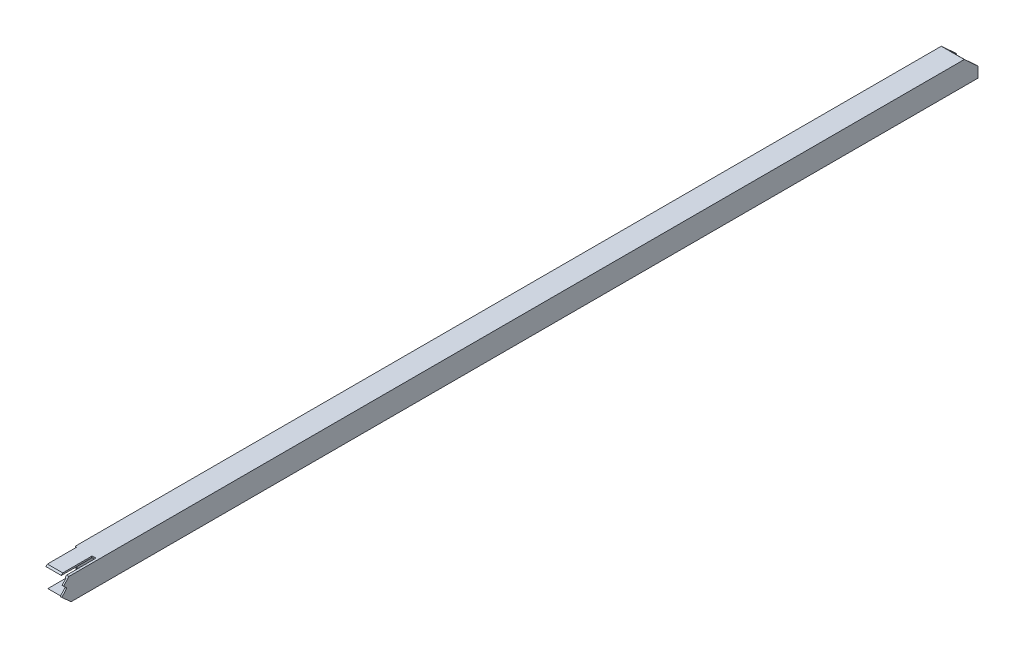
ISO-10303-21;
HEADER;
FILE_DESCRIPTION(('STEP AP214'),'2;1');
FILE_NAME('part.step','',(''),(''),'','','');
FILE_SCHEMA(('AUTOMOTIVE_DESIGN { 1 0 10303 214 1 1 1 1 }'));
ENDSEC;
DATA;
#1=APPLICATION_CONTEXT('core data for automotive mechanical design processes');
#2=APPLICATION_PROTOCOL_DEFINITION('international standard','automotive_design',2000,#1);
#3=PRODUCT_CONTEXT('',#1,'mechanical');
#4=PRODUCT('Part','Part','',(#3));
#5=PRODUCT_RELATED_PRODUCT_CATEGORY('part','',(#4));
#6=PRODUCT_DEFINITION_FORMATION('','',#4);
#7=PRODUCT_DEFINITION_CONTEXT('part definition',#1,'design');
#8=PRODUCT_DEFINITION('design','',#6,#7);
#9=PRODUCT_DEFINITION_SHAPE('','',#8);
#10=(LENGTH_UNIT() NAMED_UNIT(*) SI_UNIT(.MILLI.,.METRE.));
#11=(NAMED_UNIT(*) PLANE_ANGLE_UNIT() SI_UNIT($,.RADIAN.));
#12=(NAMED_UNIT(*) SI_UNIT($,.STERADIAN.) SOLID_ANGLE_UNIT());
#13=UNCERTAINTY_MEASURE_WITH_UNIT(LENGTH_MEASURE(1.E-05),#10,'distance_accuracy_value','');
#14=(GEOMETRIC_REPRESENTATION_CONTEXT(3) GLOBAL_UNCERTAINTY_ASSIGNED_CONTEXT((#13)) GLOBAL_UNIT_ASSIGNED_CONTEXT((#10,
#11,#12)) REPRESENTATION_CONTEXT('',''));
#15=CARTESIAN_POINT('',(0.,0.,0.));
#16=DIRECTION('',(0.,0.,1.));
#17=DIRECTION('',(1.,0.,0.));
#18=AXIS2_PLACEMENT_3D('',#15,#16,#17);
#19=CARTESIAN_POINT('',(24.,3.344636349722,2323.848652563));
#20=DIRECTION('',(-1.,0.,0.));
#21=DIRECTION('',(0.,0.,1.));
#22=AXIS2_PLACEMENT_3D('',#19,#20,#21);
#23=PLANE('',#22);
#24=DIRECTION('',(0.,0.,-1.));
#25=VECTOR('',#24,1.);
#26=CARTESIAN_POINT('',(24.,30.,1161.924326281));
#27=LINE('',#26,#25);
#28=CARTESIAN_POINT('',(24.,30.,2369.268578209));
#29=VERTEX_POINT('',#28);
#30=CARTESIAN_POINT('',(24.,30.,2294.595069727));
#31=VERTEX_POINT('',#30);
#32=EDGE_CURVE('E155',#29,#31,#27,.T.);
#33=ORIENTED_EDGE('',*,*,#32,.T.);
#34=DIRECTION('',(0.,-0.999022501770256,-0.0442045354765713));
#35=VECTOR('',#34,1.);
#36=CARTESIAN_POINT('',(24.,110.65093685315,2298.163695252));
#37=LINE('',#36,#35);
#38=CARTESIAN_POINT('',(24.,26.,2294.418078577));
#39=VERTEX_POINT('',#38);
#40=EDGE_CURVE('E10',#31,#39,#37,.T.);
#41=ORIENTED_EDGE('',*,*,#40,.T.);
#42=DIRECTION('',(0.,0.,-1.));
#43=VECTOR('',#42,1.);
#44=CARTESIAN_POINT('',(24.,26.,1161.924326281));
#45=LINE('',#44,#43);
#46=CARTESIAN_POINT('',(24.,26.,2372.929595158));
#47=VERTEX_POINT('',#46);
#48=EDGE_CURVE('E152',#47,#39,#45,.T.);
#49=ORIENTED_EDGE('',*,*,#48,.F.);
#50=DIRECTION('',(0.,-0.737672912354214,0.675158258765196));
#51=VECTOR('',#50,1.);
#52=CARTESIAN_POINT('',(24.,645.40501344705,1806.016532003));
#53=LINE('',#52,#51);
#54=EDGE_CURVE('E308',#29,#47,#53,.T.);
#55=ORIENTED_EDGE('',*,*,#54,.F.);
#56=EDGE_LOOP('',(#33,#41,#49,#55));
#57=FACE_BOUND('',#56,.T.);
#58=ADVANCED_FACE('F16',(#57),#23,.T.);
#59=CARTESIAN_POINT('',(22.,110.65093685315,2298.163695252));
#60=DIRECTION('',(0.,-0.999022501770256,-0.0442045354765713));
#61=DIRECTION('',(-1.,0.,0.));
#62=AXIS2_PLACEMENT_3D('',#59,#60,#61);
#63=CYLINDRICAL_SURFACE('',#62,2.);
#64=CARTESIAN_POINT('',(22.000000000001,26.,2294.418078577));
#65=DIRECTION('',(0.,-1.,0.));
#66=DIRECTION('',(0.,0.,-1.));
#67=AXIS2_PLACEMENT_3D('',#64,#65,#66);
#68=ELLIPSE('',#67,2.001956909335,2.);
#69=CARTESIAN_POINT('',(22.,26.,2292.416121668));
#70=VERTEX_POINT('',#69);
#71=EDGE_CURVE('E160',#70,#39,#68,.T.);
#72=ORIENTED_EDGE('',*,*,#71,.T.);
#73=ORIENTED_EDGE('',*,*,#40,.F.);
#74=CARTESIAN_POINT('',(22.000000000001,30.,2294.595069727));
#75=DIRECTION('',(0.,-1.,0.));
#76=DIRECTION('',(0.,0.,-1.));
#77=AXIS2_PLACEMENT_3D('',#74,#75,#76);
#78=ELLIPSE('',#77,2.001956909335,2.);
#79=CARTESIAN_POINT('',(22.,30.,2292.593112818));
#80=VERTEX_POINT('',#79);
#81=EDGE_CURVE('E325',#80,#31,#78,.T.);
#82=ORIENTED_EDGE('',*,*,#81,.F.);
#83=DIRECTION('',(0.,-0.999022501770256,-0.0442045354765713));
#84=VECTOR('',#83,1.);
#85=CARTESIAN_POINT('',(22.,110.7393459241,2296.165650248));
#86=LINE('',#85,#84);
#87=EDGE_CURVE('E25',#80,#70,#86,.T.);
#88=ORIENTED_EDGE('',*,*,#87,.T.);
#89=EDGE_LOOP('',(#72,#73,#82,#88));
#90=FACE_BOUND('',#89,.T.);
#91=ADVANCED_FACE('F161',(#90),#63,.F.);
#92=CARTESIAN_POINT('',(22.,110.7393459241,2296.165650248));
#93=DIRECTION('',(0.,-0.0442045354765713,0.999022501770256));
#94=DIRECTION('',(-1.,0.,0.));
#95=AXIS2_PLACEMENT_3D('',#92,#93,#94);
#96=PLANE('',#95);
#97=ORIENTED_EDGE('',*,*,#87,.F.);
#98=DIRECTION('',(-1.,0.,0.));
#99=VECTOR('',#98,1.);
#100=CARTESIAN_POINT('',(26.,30.,2292.593112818));
#101=LINE('',#100,#99);
#102=CARTESIAN_POINT('',(16.,30.,2292.593112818));
#103=VERTEX_POINT('',#102);
#104=EDGE_CURVE('E321',#80,#103,#101,.T.);
#105=ORIENTED_EDGE('',*,*,#104,.T.);
#106=DIRECTION('',(0.,-0.999022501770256,-0.0442045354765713));
#107=VECTOR('',#106,1.);
#108=CARTESIAN_POINT('',(16.,110.7393459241,2296.165650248));
#109=LINE('',#108,#107);
#110=CARTESIAN_POINT('',(16.,26.,2292.416121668));
#111=VERTEX_POINT('',#110);
#112=EDGE_CURVE('E242',#103,#111,#109,.T.);
#113=ORIENTED_EDGE('',*,*,#112,.T.);
#114=DIRECTION('',(-1.,0.,0.));
#115=VECTOR('',#114,1.);
#116=CARTESIAN_POINT('',(24.,26.,2292.416121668));
#117=LINE('',#116,#115);
#118=EDGE_CURVE('E166',#70,#111,#117,.T.);
#119=ORIENTED_EDGE('',*,*,#118,.F.);
#120=EDGE_LOOP('',(#97,#105,#113,#119));
#121=FACE_BOUND('',#120,.T.);
#122=ADVANCED_FACE('F695',(#121),#96,.T.);
#123=CARTESIAN_POINT('',(16.,110.65093685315,2298.163695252));
#124=DIRECTION('',(0.,-0.999022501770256,-0.0442045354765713));
#125=DIRECTION('',(1.,0.,0.));
#126=AXIS2_PLACEMENT_3D('',#123,#124,#125);
#127=CYLINDRICAL_SURFACE('',#126,2.);
#128=ORIENTED_EDGE('',*,*,#112,.F.);
#129=CARTESIAN_POINT('',(16.,30.,2294.595069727));
#130=DIRECTION('',(0.,-1.,0.));
#131=DIRECTION('',(0.,0.,-1.));
#132=AXIS2_PLACEMENT_3D('',#129,#130,#131);
#133=ELLIPSE('',#132,2.001956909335,2.);
#134=CARTESIAN_POINT('',(14.,30.,2294.595069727));
#135=VERTEX_POINT('',#134);
#136=EDGE_CURVE('E317',#135,#103,#133,.T.);
#137=ORIENTED_EDGE('',*,*,#136,.F.);
#138=DIRECTION('',(0.,-0.999022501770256,-0.0442045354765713));
#139=VECTOR('',#138,1.);
#140=CARTESIAN_POINT('',(14.,110.65093685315,2298.163695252));
#141=LINE('',#140,#139);
#142=CARTESIAN_POINT('',(14.,26.,2294.418078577));
#143=VERTEX_POINT('',#142);
#144=EDGE_CURVE('E239',#135,#143,#141,.T.);
#145=ORIENTED_EDGE('',*,*,#144,.T.);
#146=CARTESIAN_POINT('',(16.,26.,2294.418078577));
#147=DIRECTION('',(0.,-1.,0.));
#148=DIRECTION('',(0.,0.,-1.));
#149=AXIS2_PLACEMENT_3D('',#146,#147,#148);
#150=ELLIPSE('',#149,2.001956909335,2.);
#151=EDGE_CURVE('E228',#143,#111,#150,.T.);
#152=ORIENTED_EDGE('',*,*,#151,.T.);
#153=EDGE_LOOP('',(#128,#137,#145,#152));
#154=FACE_BOUND('',#153,.T.);
#155=ADVANCED_FACE('F694',(#154),#127,.F.);
#156=CARTESIAN_POINT('',(14.,3.344636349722,2323.848652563));
#157=DIRECTION('',(-1.,0.,0.));
#158=DIRECTION('',(0.,0.,1.));
#159=AXIS2_PLACEMENT_3D('',#156,#157,#158);
#160=PLANE('',#159);
#161=DIRECTION('',(0.,-0.737672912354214,0.675158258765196));
#162=VECTOR('',#161,1.);
#163=CARTESIAN_POINT('',(14.,645.40501344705,1806.016532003));
#164=LINE('',#163,#162);
#165=CARTESIAN_POINT('',(14.,30.,2369.268578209));
#166=VERTEX_POINT('',#165);
#167=CARTESIAN_POINT('',(14.,26.,2372.929595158));
#168=VERTEX_POINT('',#167);
#169=EDGE_CURVE('E37',#166,#168,#164,.T.);
#170=ORIENTED_EDGE('',*,*,#169,.T.);
#171=DIRECTION('',(0.,0.,-1.));
#172=VECTOR('',#171,1.);
#173=CARTESIAN_POINT('',(14.,26.,1161.924326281));
#174=LINE('',#173,#172);
#175=EDGE_CURVE('E224',#168,#143,#174,.T.);
#176=ORIENTED_EDGE('',*,*,#175,.T.);
#177=ORIENTED_EDGE('',*,*,#144,.F.);
#178=DIRECTION('',(0.,0.,-1.));
#179=VECTOR('',#178,1.);
#180=CARTESIAN_POINT('',(14.,30.,1161.924326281));
#181=LINE('',#180,#179);
#182=EDGE_CURVE('E313',#166,#135,#181,.T.);
#183=ORIENTED_EDGE('',*,*,#182,.F.);
#184=EDGE_LOOP('',(#170,#176,#177,#183));
#185=FACE_BOUND('',#184,.T.);
#186=ADVANCED_FACE('F692',(#185),#160,.F.);
#187=CARTESIAN_POINT('',(-37.5,1252.693634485,1250.193048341));
#188=DIRECTION('',(0.,0.675158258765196,0.737672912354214));
#189=DIRECTION('',(1.,0.,0.));
#190=AXIS2_PLACEMENT_3D('',#187,#188,#189);
#191=PLANE('',#190);
#192=DIRECTION('',(-1.,0.,0.));
#193=VECTOR('',#192,1.);
#194=CARTESIAN_POINT('',(-5.75,26.,2372.929595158));
#195=LINE('',#194,#193);
#196=CARTESIAN_POINT('',(-26.,26.,2372.929595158));
#197=VERTEX_POINT('',#196);
#198=EDGE_CURVE('E227',#168,#197,#195,.T.);
#199=ORIENTED_EDGE('',*,*,#198,.F.);
#200=ORIENTED_EDGE('',*,*,#169,.F.);
#201=DIRECTION('',(-1.,0.,0.));
#202=VECTOR('',#201,1.);
#203=CARTESIAN_POINT('',(-3.75,30.,2369.268578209));
#204=LINE('',#203,#202);
#205=CARTESIAN_POINT('',(-26.,30.,2369.268578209));
#206=VERTEX_POINT('',#205);
#207=EDGE_CURVE('E309',#166,#206,#204,.T.);
#208=ORIENTED_EDGE('',*,*,#207,.T.);
#209=DIRECTION('',(0.,-0.737672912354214,0.675158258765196));
#210=VECTOR('',#209,1.);
#211=CARTESIAN_POINT('',(-26.,645.40501344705,1806.016532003));
#212=LINE('',#211,#210);
#213=EDGE_CURVE('E174',#206,#197,#212,.T.);
#214=ORIENTED_EDGE('',*,*,#213,.T.);
#215=EDGE_LOOP('',(#199,#200,#208,#214));
#216=FACE_BOUND('',#215,.T.);
#217=ADVANCED_FACE('F689',(#216),#191,.T.);
#218=CARTESIAN_POINT('',(26.,26.,0.));
#219=DIRECTION('',(0.,-1.,0.));
#220=DIRECTION('',(0.,0.,-1.));
#221=AXIS2_PLACEMENT_3D('',#218,#219,#220);
#222=PLANE('',#221);
#223=DIRECTION('',(-1.,0.,0.));
#224=VECTOR('',#223,1.);
#225=CARTESIAN_POINT('',(-8.00000005,26.,31.36967599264));
#226=LINE('',#225,#224);
#227=CARTESIAN_POINT('',(26.,26.,31.36967599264));
#228=VERTEX_POINT('',#227);
#229=CARTESIAN_POINT('',(-26.,26.,31.36967599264));
#230=VERTEX_POINT('',#229);
#231=EDGE_CURVE('E247',#228,#230,#226,.T.);
#232=ORIENTED_EDGE('',*,*,#231,.F.);
#233=DIRECTION('',(0.,0.,1.));
#234=VECTOR('',#233,1.);
#235=CARTESIAN_POINT('',(26.,26.,0.));
#236=LINE('',#235,#234);
#237=CARTESIAN_POINT('',(26.,26.,2372.929595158));
#238=VERTEX_POINT('',#237);
#239=EDGE_CURVE('E301',#228,#238,#236,.T.);
#240=ORIENTED_EDGE('',*,*,#239,.T.);
#241=DIRECTION('',(-1.,0.,0.));
#242=VECTOR('',#241,1.);
#243=CARTESIAN_POINT('',(-5.75,26.,2372.929595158));
#244=LINE('',#243,#242);
#245=EDGE_CURVE('E171',#238,#47,#244,.T.);
#246=ORIENTED_EDGE('',*,*,#245,.T.);
#247=ORIENTED_EDGE('',*,*,#48,.T.);
#248=ORIENTED_EDGE('',*,*,#71,.F.);
#249=ORIENTED_EDGE('',*,*,#118,.T.);
#250=ORIENTED_EDGE('',*,*,#151,.F.);
#251=ORIENTED_EDGE('',*,*,#175,.F.);
#252=ORIENTED_EDGE('',*,*,#198,.T.);
#253=DIRECTION('',(0.,0.,1.));
#254=VECTOR('',#253,1.);
#255=CARTESIAN_POINT('',(-26.,26.,0.));
#256=LINE('',#255,#254);
#257=CARTESIAN_POINT('',(-26.,26.,2294.418078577));
#258=VERTEX_POINT('',#257);
#259=EDGE_CURVE('E181',#258,#197,#256,.T.);
#260=ORIENTED_EDGE('',*,*,#259,.F.);
#261=DIRECTION('',(0.,0.,1.));
#262=VECTOR('',#261,1.);
#263=CARTESIAN_POINT('',(-26.,26.,0.));
#264=LINE('',#263,#262);
#265=EDGE_CURVE('E274',#230,#258,#264,.T.);
#266=ORIENTED_EDGE('',*,*,#265,.F.);
#267=EDGE_LOOP('',(#232,#240,#246,#247,#248,#249,#250,#251,#252,#260,#266));
#268=FACE_BOUND('',#267,.T.);
#269=ADVANCED_FACE('F169',(#268),#222,.T.);
#270=CARTESIAN_POINT('',(-26.,3.344636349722,2323.848652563));
#271=DIRECTION('',(-1.,0.,0.));
#272=DIRECTION('',(0.,0.,1.));
#273=AXIS2_PLACEMENT_3D('',#270,#271,#272);
#274=PLANE('',#273);
#275=DIRECTION('',(0.,0.,-1.));
#276=VECTOR('',#275,1.);
#277=CARTESIAN_POINT('',(-26.,30.,1161.924326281));
#278=LINE('',#277,#276);
#279=CARTESIAN_POINT('',(-26.,30.,2294.595069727));
#280=VERTEX_POINT('',#279);
#281=EDGE_CURVE('E304',#206,#280,#278,.T.);
#282=ORIENTED_EDGE('',*,*,#281,.T.);
#283=DIRECTION('',(0.,-0.999022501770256,-0.0442045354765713));
#284=VECTOR('',#283,1.);
#285=CARTESIAN_POINT('',(-26.,110.65093685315,2298.163695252));
#286=LINE('',#285,#284);
#287=EDGE_CURVE('E191',#280,#258,#286,.T.);
#288=ORIENTED_EDGE('',*,*,#287,.T.);
#289=ORIENTED_EDGE('',*,*,#259,.T.);
#290=ORIENTED_EDGE('',*,*,#213,.F.);
#291=EDGE_LOOP('',(#282,#288,#289,#290));
#292=FACE_BOUND('',#291,.T.);
#293=ADVANCED_FACE('F657',(#292),#274,.T.);
#294=CARTESIAN_POINT('',(0.,-38.95913211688,2416.116343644));
#295=DIRECTION('',(0.,0.675158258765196,0.737672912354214));
#296=DIRECTION('',(1.,0.,0.));
#297=AXIS2_PLACEMENT_3D('',#294,#295,#296);
#298=PLANE('',#297);
#299=DIRECTION('',(-1.,0.,0.));
#300=VECTOR('',#299,1.);
#301=CARTESIAN_POINT('',(60.,5.301242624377,2375.606848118));
#302=LINE('',#301,#300);
#303=CARTESIAN_POINT('',(30.,5.301242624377,2375.606848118));
#304=VERTEX_POINT('',#303);
#305=CARTESIAN_POINT('',(26.,5.301242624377,2375.606848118));
#306=VERTEX_POINT('',#305);
#307=EDGE_CURVE('E337',#304,#306,#302,.T.);
#308=ORIENTED_EDGE('',*,*,#307,.T.);
#309=DIRECTION('',(0.,0.737672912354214,-0.675158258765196));
#310=VECTOR('',#309,1.);
#311=CARTESIAN_POINT('',(26.,566.23528790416,1862.209586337));
#312=LINE('',#311,#310);
#313=CARTESIAN_POINT('',(26.,-7.976869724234,2387.759696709));
#314=VERTEX_POINT('',#313);
#315=EDGE_CURVE('E285',#314,#306,#312,.T.);
#316=ORIENTED_EDGE('',*,*,#315,.F.);
#317=DIRECTION('',(-1.,0.,0.));
#318=VECTOR('',#317,1.);
#319=CARTESIAN_POINT('',(-21.00000005,-7.976869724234,2387.759696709));
#320=LINE('',#319,#318);
#321=CARTESIAN_POINT('',(30.,-7.976869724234,2387.759696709));
#322=VERTEX_POINT('',#321);
#323=EDGE_CURVE('E477',#322,#314,#320,.T.);
#324=ORIENTED_EDGE('',*,*,#323,.F.);
#325=DIRECTION('',(0.,0.737672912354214,-0.675158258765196));
#326=VECTOR('',#325,1.);
#327=CARTESIAN_POINT('',(30.,565.14696525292,1863.205678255));
#328=LINE('',#327,#326);
#329=EDGE_CURVE('E466',#322,#304,#328,.T.);
#330=ORIENTED_EDGE('',*,*,#329,.T.);
#331=EDGE_LOOP('',(#308,#316,#324,#330));
#332=FACE_BOUND('',#331,.T.);
#333=ADVANCED_FACE('F712',(#332),#298,.T.);
#334=CARTESIAN_POINT('',(60.,6.651559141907,2377.082193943));
#335=DIRECTION('',(-1.,0.,0.));
#336=DIRECTION('',(0.,0.675158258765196,0.737672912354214));
#337=AXIS2_PLACEMENT_3D('',#334,#335,#336);
#338=CYLINDRICAL_SURFACE('',#337,2.);
#339=CARTESIAN_POINT('',(26.,6.651559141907,2377.082193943));
#340=DIRECTION('',(-1.,0.,0.));
#341=DIRECTION('',(0.,0.675158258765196,0.737672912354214));
#342=AXIS2_PLACEMENT_3D('',#339,#340,#341);
#343=CIRCLE('',#342,2.);
#344=CARTESIAN_POINT('',(26.,8.126904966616,2375.731877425));
#345=VERTEX_POINT('',#344);
#346=EDGE_CURVE('E289',#345,#306,#343,.T.);
#347=ORIENTED_EDGE('',*,*,#346,.T.);
#348=ORIENTED_EDGE('',*,*,#307,.F.);
#349=CARTESIAN_POINT('',(30.,6.651559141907,2377.082193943));
#350=DIRECTION('',(-1.,0.,0.));
#351=DIRECTION('',(0.,0.675158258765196,0.737672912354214));
#352=AXIS2_PLACEMENT_3D('',#349,#350,#351);
#353=CIRCLE('',#352,2.);
#354=CARTESIAN_POINT('',(30.,8.126904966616,2375.731877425));
#355=VERTEX_POINT('',#354);
#356=EDGE_CURVE('E412',#355,#304,#353,.T.);
#357=ORIENTED_EDGE('',*,*,#356,.F.);
#358=DIRECTION('',(-1.,0.,0.));
#359=VECTOR('',#358,1.);
#360=CARTESIAN_POINT('',(60.,8.126904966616,2375.731877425));
#361=LINE('',#360,#359);
#362=EDGE_CURVE('E307',#355,#345,#361,.T.);
#363=ORIENTED_EDGE('',*,*,#362,.T.);
#364=EDGE_LOOP('',(#347,#348,#357,#363));
#365=FACE_BOUND('',#364,.T.);
#366=ADVANCED_FACE('F710',(#365),#338,.F.);
#367=CARTESIAN_POINT('',(60.,8.126904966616,2375.731877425));
#368=DIRECTION('',(0.,-0.737672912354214,0.675158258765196));
#369=DIRECTION('',(-1.,0.,0.));
#370=AXIS2_PLACEMENT_3D('',#367,#368,#369);
#371=PLANE('',#370);
#372=ORIENTED_EDGE('',*,*,#362,.F.);
#373=DIRECTION('',(0.,0.675158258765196,0.737672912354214));
#374=VECTOR('',#373,1.);
#375=CARTESIAN_POINT('',(30.,-592.1747846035,1719.84669808));
#376=LINE('',#375,#374);
#377=CARTESIAN_POINT('',(30.,14.878487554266,2383.108606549));
#378=VERTEX_POINT('',#377);
#379=EDGE_CURVE('E408',#355,#378,#376,.T.);
#380=ORIENTED_EDGE('',*,*,#379,.T.);
#381=DIRECTION('',(1.,0.,0.));
#382=VECTOR('',#381,1.);
#383=CARTESIAN_POINT('',(11.25,14.878487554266,2383.108606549));
#384=LINE('',#383,#382);
#385=CARTESIAN_POINT('',(26.,14.878487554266,2383.108606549));
#386=VERTEX_POINT('',#385);
#387=EDGE_CURVE('E331',#386,#378,#384,.T.);
#388=ORIENTED_EDGE('',*,*,#387,.F.);
#389=DIRECTION('',(0.,0.675158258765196,0.737672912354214));
#390=VECTOR('',#389,1.);
#391=CARTESIAN_POINT('',(26.,-591.2631072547,1720.842789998));
#392=LINE('',#391,#390);
#393=EDGE_CURVE('E293',#345,#386,#392,.T.);
#394=ORIENTED_EDGE('',*,*,#393,.F.);
#395=EDGE_LOOP('',(#372,#380,#388,#394));
#396=FACE_BOUND('',#395,.T.);
#397=ADVANCED_FACE('F707',(#396),#371,.T.);
#398=CARTESIAN_POINT('',(-37.5,1252.693634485,1250.193048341));
#399=DIRECTION('',(0.,0.675158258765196,0.737672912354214));
#400=DIRECTION('',(1.,0.,0.));
#401=AXIS2_PLACEMENT_3D('',#398,#399,#400);
#402=PLANE('',#401);
#403=DIRECTION('',(0.,0.737672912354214,-0.675158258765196));
#404=VECTOR('',#403,1.);
#405=CARTESIAN_POINT('',(26.,1216.112620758,1283.673976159));
#406=LINE('',#405,#404);
#407=EDGE_CURVE('E297',#386,#238,#406,.T.);
#408=ORIENTED_EDGE('',*,*,#407,.F.);
#409=ORIENTED_EDGE('',*,*,#387,.T.);
#410=DIRECTION('',(0.,0.737672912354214,-0.675158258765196));
#411=VECTOR('',#410,1.);
#412=CARTESIAN_POINT('',(30.,1215.024298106,1284.670068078));
#413=LINE('',#412,#411);
#414=CARTESIAN_POINT('',(30.,30.,2369.268578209));
#415=VERTEX_POINT('',#414);
#416=EDGE_CURVE('E413',#378,#415,#413,.T.);
#417=ORIENTED_EDGE('',*,*,#416,.T.);
#418=DIRECTION('',(-1.,0.,0.));
#419=VECTOR('',#418,1.);
#420=CARTESIAN_POINT('',(-3.75,30.,2369.268578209));
#421=LINE('',#420,#419);
#422=EDGE_CURVE('E330',#415,#29,#421,.T.);
#423=ORIENTED_EDGE('',*,*,#422,.T.);
#424=ORIENTED_EDGE('',*,*,#54,.T.);
#425=ORIENTED_EDGE('',*,*,#245,.F.);
#426=EDGE_LOOP('',(#408,#409,#417,#423,#424,#425));
#427=FACE_BOUND('',#426,.T.);
#428=ADVANCED_FACE('F700',(#427),#402,.T.);
#429=CARTESIAN_POINT('',(30.,30.,0.));
#430=DIRECTION('',(0.,-1.,0.));
#431=DIRECTION('',(0.,0.,-1.));
#432=AXIS2_PLACEMENT_3D('',#429,#430,#431);
#433=PLANE('',#432);
#434=DIRECTION('',(0.,0.,1.));
#435=VECTOR('',#434,1.);
#436=CARTESIAN_POINT('',(-30.,30.,0.));
#437=LINE('',#436,#435);
#438=CARTESIAN_POINT('',(-30.,30.,35.74004636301));
#439=VERTEX_POINT('',#438);
#440=CARTESIAN_POINT('',(-30.,30.,2292.593112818));
#441=VERTEX_POINT('',#440);
#442=EDGE_CURVE('E258',#439,#441,#437,.T.);
#443=ORIENTED_EDGE('',*,*,#442,.T.);
#444=DIRECTION('',(-1.,0.,0.));
#445=VECTOR('',#444,1.);
#446=CARTESIAN_POINT('',(1.,30.,2292.593112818));
#447=LINE('',#446,#445);
#448=CARTESIAN_POINT('',(-28.,30.,2292.593112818));
#449=VERTEX_POINT('',#448);
#450=EDGE_CURVE('E253',#449,#441,#447,.T.);
#451=ORIENTED_EDGE('',*,*,#450,.F.);
#452=CARTESIAN_POINT('',(-27.99999999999,30.,2294.595069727));
#453=DIRECTION('',(0.,-1.,0.));
#454=DIRECTION('',(0.,0.,-1.));
#455=AXIS2_PLACEMENT_3D('',#452,#453,#454);
#456=ELLIPSE('',#455,2.001956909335,2.);
#457=EDGE_CURVE('E195',#449,#280,#456,.T.);
#458=ORIENTED_EDGE('',*,*,#457,.T.);
#459=ORIENTED_EDGE('',*,*,#281,.F.);
#460=ORIENTED_EDGE('',*,*,#207,.F.);
#461=ORIENTED_EDGE('',*,*,#182,.T.);
#462=ORIENTED_EDGE('',*,*,#136,.T.);
#463=ORIENTED_EDGE('',*,*,#104,.F.);
#464=ORIENTED_EDGE('',*,*,#81,.T.);
#465=ORIENTED_EDGE('',*,*,#32,.F.);
#466=ORIENTED_EDGE('',*,*,#422,.F.);
#467=DIRECTION('',(0.,0.,1.));
#468=VECTOR('',#467,1.);
#469=CARTESIAN_POINT('',(30.,30.,0.));
#470=LINE('',#469,#468);
#471=CARTESIAN_POINT('',(30.,30.,35.74004636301));
#472=VERTEX_POINT('',#471);
#473=EDGE_CURVE('E455',#472,#415,#470,.T.);
#474=ORIENTED_EDGE('',*,*,#473,.F.);
#475=DIRECTION('',(-1.,0.,0.));
#476=VECTOR('',#475,1.);
#477=CARTESIAN_POINT('',(-6.00000005,30.,35.74004636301));
#478=LINE('',#477,#476);
#479=EDGE_CURVE('E271',#472,#439,#478,.T.);
#480=ORIENTED_EDGE('',*,*,#479,.T.);
#481=EDGE_LOOP('',(#443,#451,#458,#459,#460,#461,#462,#463,#464,#465,#466,#474,#480));
#482=FACE_BOUND('',#481,.T.);
#483=ADVANCED_FACE('F663',(#482),#433,.F.);
#484=CARTESIAN_POINT('',(26.,-26.,0.));
#485=DIRECTION('',(-1.,0.,0.));
#486=DIRECTION('',(0.,0.,1.));
#487=AXIS2_PLACEMENT_3D('',#484,#485,#486);
#488=PLANE('',#487);
#489=DIRECTION('',(0.,1.,0.));
#490=VECTOR('',#489,1.);
#491=CARTESIAN_POINT('',(26.,-26.,0.));
#492=LINE('',#491,#490);
#493=CARTESIAN_POINT('',(26.,-26.,0.));
#494=VERTEX_POINT('',#493);
#495=CARTESIAN_POINT('',(26.,-2.71122887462,0.));
#496=VERTEX_POINT('',#495);
#497=EDGE_CURVE('E430',#494,#496,#492,.T.);
#498=ORIENTED_EDGE('',*,*,#497,.F.);
#499=DIRECTION('',(0.,0.,1.));
#500=VECTOR('',#499,1.);
#501=CARTESIAN_POINT('',(26.,-26.,0.));
#502=LINE('',#501,#500);
#503=CARTESIAN_POINT('',(26.,-26.,2368.067758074));
#504=VERTEX_POINT('',#503);
#505=EDGE_CURVE('E281',#494,#504,#502,.T.);
#506=ORIENTED_EDGE('',*,*,#505,.T.);
#507=DIRECTION('',(0.,0.675158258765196,0.737672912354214));
#508=VECTOR('',#507,1.);
#509=CARTESIAN_POINT('',(26.,-1244.041119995,1037.245052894));
#510=LINE('',#509,#508);
#511=EDGE_CURVE('E490',#504,#314,#510,.T.);
#512=ORIENTED_EDGE('',*,*,#511,.T.);
#513=ORIENTED_EDGE('',*,*,#315,.T.);
#514=ORIENTED_EDGE('',*,*,#346,.F.);
#515=ORIENTED_EDGE('',*,*,#393,.T.);
#516=ORIENTED_EDGE('',*,*,#407,.T.);
#517=ORIENTED_EDGE('',*,*,#239,.F.);
#518=DIRECTION('',(0.,0.675158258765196,0.737672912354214));
#519=VECTOR('',#518,1.);
#520=CARTESIAN_POINT('',(26.,-51.96169377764,-53.81069313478));
#521=LINE('',#520,#519);
#522=EDGE_CURVE('E243',#496,#228,#521,.T.);
#523=ORIENTED_EDGE('',*,*,#522,.F.);
#524=EDGE_LOOP('',(#498,#506,#512,#513,#514,#515,#516,#517,#523));
#525=FACE_BOUND('',#524,.T.);
#526=ADVANCED_FACE('F703',(#525),#488,.T.);
#527=CARTESIAN_POINT('',(-26.,-26.,0.));
#528=DIRECTION('',(0.,1.,0.));
#529=DIRECTION('',(1.,0.,0.));
#530=AXIS2_PLACEMENT_3D('',#527,#528,#529);
#531=PLANE('',#530);
#532=DIRECTION('',(1.,0.,0.));
#533=VECTOR('',#532,1.);
#534=CARTESIAN_POINT('',(-26.,-26.,0.));
#535=LINE('',#534,#533);
#536=CARTESIAN_POINT('',(-26.,-26.,0.));
#537=VERTEX_POINT('',#536);
#538=EDGE_CURVE('E426',#537,#494,#535,.T.);
#539=ORIENTED_EDGE('',*,*,#538,.F.);
#540=DIRECTION('',(0.,0.,1.));
#541=VECTOR('',#540,1.);
#542=CARTESIAN_POINT('',(-26.,-26.,0.));
#543=LINE('',#542,#541);
#544=CARTESIAN_POINT('',(-26.,-26.,2292.117193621));
#545=VERTEX_POINT('',#544);
#546=EDGE_CURVE('E278',#537,#545,#543,.T.);
#547=ORIENTED_EDGE('',*,*,#546,.T.);
#548=DIRECTION('',(0.,0.,1.));
#549=VECTOR('',#548,1.);
#550=CARTESIAN_POINT('',(-26.,-26.,0.));
#551=LINE('',#550,#549);
#552=CARTESIAN_POINT('',(-26.,-26.,2368.067758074));
#553=VERTEX_POINT('',#552);
#554=EDGE_CURVE('E236',#545,#553,#551,.T.);
#555=ORIENTED_EDGE('',*,*,#554,.T.);
#556=DIRECTION('',(1.,0.,0.));
#557=VECTOR('',#556,1.);
#558=CARTESIAN_POINT('',(-34.00000005,-26.,2368.067758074));
#559=LINE('',#558,#557);
#560=CARTESIAN_POINT('',(14.,-26.,2368.067758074));
#561=VERTEX_POINT('',#560);
#562=EDGE_CURVE('E220',#553,#561,#559,.T.);
#563=ORIENTED_EDGE('',*,*,#562,.T.);
#564=DIRECTION('',(0.,0.,1.));
#565=VECTOR('',#564,1.);
#566=CARTESIAN_POINT('',(14.,-26.,1161.924326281));
#567=LINE('',#566,#565);
#568=CARTESIAN_POINT('',(14.,-26.,2292.117193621));
#569=VERTEX_POINT('',#568);
#570=EDGE_CURVE('E212',#569,#561,#567,.T.);
#571=ORIENTED_EDGE('',*,*,#570,.F.);
#572=CARTESIAN_POINT('',(16.,-26.,2292.117193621));
#573=DIRECTION('',(0.,1.,0.));
#574=DIRECTION('',(0.,0.,-1.));
#575=AXIS2_PLACEMENT_3D('',#572,#573,#574);
#576=ELLIPSE('',#575,2.001956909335,2.);
#577=CARTESIAN_POINT('',(16.,-26.,2290.115236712));
#578=VERTEX_POINT('',#577);
#579=EDGE_CURVE('E204',#578,#569,#576,.T.);
#580=ORIENTED_EDGE('',*,*,#579,.F.);
#581=DIRECTION('',(1.,0.,0.));
#582=VECTOR('',#581,1.);
#583=CARTESIAN_POINT('',(-2.,-26.,2290.115236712));
#584=LINE('',#583,#582);
#585=CARTESIAN_POINT('',(22.,-26.,2290.115236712));
#586=VERTEX_POINT('',#585);
#587=EDGE_CURVE('E197',#578,#586,#584,.T.);
#588=ORIENTED_EDGE('',*,*,#587,.T.);
#589=CARTESIAN_POINT('',(22.000000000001,-26.,2292.117193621));
#590=DIRECTION('',(0.,1.,0.));
#591=DIRECTION('',(0.,0.,-1.));
#592=AXIS2_PLACEMENT_3D('',#589,#590,#591);
#593=ELLIPSE('',#592,2.001956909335,2.);
#594=CARTESIAN_POINT('',(24.,-26.,2292.117193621));
#595=VERTEX_POINT('',#594);
#596=EDGE_CURVE('E187',#595,#586,#593,.T.);
#597=ORIENTED_EDGE('',*,*,#596,.F.);
#598=DIRECTION('',(0.,0.,1.));
#599=VECTOR('',#598,1.);
#600=CARTESIAN_POINT('',(24.,-26.,1161.924326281));
#601=LINE('',#600,#599);
#602=CARTESIAN_POINT('',(24.,-26.,2368.067758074));
#603=VERTEX_POINT('',#602);
#604=EDGE_CURVE('E185',#595,#603,#601,.T.);
#605=ORIENTED_EDGE('',*,*,#604,.T.);
#606=DIRECTION('',(1.,0.,0.));
#607=VECTOR('',#606,1.);
#608=CARTESIAN_POINT('',(-34.00000005,-26.,2368.067758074));
#609=LINE('',#608,#607);
#610=EDGE_CURVE('E465',#603,#504,#609,.T.);
#611=ORIENTED_EDGE('',*,*,#610,.T.);
#612=ORIENTED_EDGE('',*,*,#505,.F.);
#613=EDGE_LOOP('',(#539,#547,#555,#563,#571,#580,#588,#597,#605,#611,#612));
#614=FACE_BOUND('',#613,.T.);
#615=ADVANCED_FACE('F514',(#614),#531,.T.);
#616=CARTESIAN_POINT('',(-26.,26.,0.));
#617=DIRECTION('',(1.,0.,0.));
#618=DIRECTION('',(0.,1.,0.));
#619=AXIS2_PLACEMENT_3D('',#616,#617,#618);
#620=PLANE('',#619);
#621=DIRECTION('',(0.,-0.675158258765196,-0.737672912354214));
#622=VECTOR('',#621,1.);
#623=CARTESIAN_POINT('',(-26.,-40.1098882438,-40.86149819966));
#624=LINE('',#623,#622);
#625=CARTESIAN_POINT('',(-26.,-2.71122887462,0.));
#626=VERTEX_POINT('',#625);
#627=EDGE_CURVE('E270',#230,#626,#624,.T.);
#628=ORIENTED_EDGE('',*,*,#627,.F.);
#629=ORIENTED_EDGE('',*,*,#265,.T.);
#630=DIRECTION('',(0.,-0.999022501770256,-0.0442045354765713));
#631=VECTOR('',#630,1.);
#632=CARTESIAN_POINT('',(-26.,110.65093685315,2298.163695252));
#633=LINE('',#632,#631);
#634=EDGE_CURVE('E196',#258,#545,#633,.T.);
#635=ORIENTED_EDGE('',*,*,#634,.T.);
#636=ORIENTED_EDGE('',*,*,#546,.F.);
#637=DIRECTION('',(0.,-1.,0.));
#638=VECTOR('',#637,1.);
#639=CARTESIAN_POINT('',(-26.,26.,0.));
#640=LINE('',#639,#638);
#641=EDGE_CURVE('E431',#626,#537,#640,.T.);
#642=ORIENTED_EDGE('',*,*,#641,.F.);
#643=EDGE_LOOP('',(#628,#629,#635,#636,#642));
#644=FACE_BOUND('',#643,.T.);
#645=ADVANCED_FACE('F670',(#644),#620,.T.);
#646=CARTESIAN_POINT('',(-42.0000001,-90.59623612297,-96.02250791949));
#647=DIRECTION('',(0.,-0.737672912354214,0.675158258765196));
#648=DIRECTION('',(-1.,0.,0.));
#649=AXIS2_PLACEMENT_3D('',#646,#647,#648);
#650=PLANE('',#649);
#651=ORIENTED_EDGE('',*,*,#522,.T.);
#652=ORIENTED_EDGE('',*,*,#231,.T.);
#653=ORIENTED_EDGE('',*,*,#627,.T.);
#654=DIRECTION('',(1.,0.,0.));
#655=VECTOR('',#654,1.);
#656=CARTESIAN_POINT('',(-21.00000005,-2.71122887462,0.));
#657=LINE('',#656,#655);
#658=CARTESIAN_POINT('',(-30.,-2.71122887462,0.));
#659=VERTEX_POINT('',#658);
#660=EDGE_CURVE('E422',#659,#626,#657,.T.);
#661=ORIENTED_EDGE('',*,*,#660,.F.);
#662=DIRECTION('',(0.,-0.675158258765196,-0.737672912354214));
#663=VECTOR('',#662,1.);
#664=CARTESIAN_POINT('',(-30.,-39.19821089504,-39.86540628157));
#665=LINE('',#664,#663);
#666=EDGE_CURVE('E248',#439,#659,#665,.T.);
#667=ORIENTED_EDGE('',*,*,#666,.F.);
#668=ORIENTED_EDGE('',*,*,#479,.F.);
#669=DIRECTION('',(0.,0.675158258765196,0.737672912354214));
#670=VECTOR('',#669,1.);
#671=CARTESIAN_POINT('',(30.,-52.8733711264,-54.80678505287));
#672=LINE('',#671,#670);
#673=CARTESIAN_POINT('',(30.,-2.71122887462,0.));
#674=VERTEX_POINT('',#673);
#675=EDGE_CURVE('E451',#674,#472,#672,.T.);
#676=ORIENTED_EDGE('',*,*,#675,.F.);
#677=DIRECTION('',(1.,0.,0.));
#678=VECTOR('',#677,1.);
#679=CARTESIAN_POINT('',(-21.00000005,-2.71122887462,0.));
#680=LINE('',#679,#678);
#681=EDGE_CURVE('E438',#496,#674,#680,.T.);
#682=ORIENTED_EDGE('',*,*,#681,.F.);
#683=EDGE_LOOP('',(#651,#652,#653,#661,#667,#668,#676,#682));
#684=FACE_BOUND('',#683,.T.);
#685=ADVANCED_FACE('F685',(#684),#650,.F.);
#686=CARTESIAN_POINT('',(-30.,30.,0.));
#687=DIRECTION('',(1.,0.,0.));
#688=DIRECTION('',(0.,1.,0.));
#689=AXIS2_PLACEMENT_3D('',#686,#687,#688);
#690=PLANE('',#689);
#691=DIRECTION('',(0.,-1.,0.));
#692=VECTOR('',#691,1.);
#693=CARTESIAN_POINT('',(-30.,30.,0.));
#694=LINE('',#693,#692);
#695=CARTESIAN_POINT('',(-30.,-30.,0.));
#696=VERTEX_POINT('',#695);
#697=EDGE_CURVE('E380',#659,#696,#694,.T.);
#698=ORIENTED_EDGE('',*,*,#697,.T.);
#699=DIRECTION('',(0.,0.,1.));
#700=VECTOR('',#699,1.);
#701=CARTESIAN_POINT('',(-30.,-30.,0.));
#702=LINE('',#701,#700);
#703=CARTESIAN_POINT('',(-30.,-30.,2289.938245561));
#704=VERTEX_POINT('',#703);
#705=EDGE_CURVE('E377',#696,#704,#702,.T.);
#706=ORIENTED_EDGE('',*,*,#705,.T.);
#707=DIRECTION('',(0.,-0.999022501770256,-0.0442045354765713));
#708=VECTOR('',#707,1.);
#709=CARTESIAN_POINT('',(-30.,19.747697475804,2292.139471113));
#710=LINE('',#709,#708);
#711=EDGE_CURVE('E256',#441,#704,#710,.T.);
#712=ORIENTED_EDGE('',*,*,#711,.F.);
#713=ORIENTED_EDGE('',*,*,#442,.F.);
#714=ORIENTED_EDGE('',*,*,#666,.T.);
#715=EDGE_LOOP('',(#698,#706,#712,#713,#714));
#716=FACE_BOUND('',#715,.T.);
#717=ADVANCED_FACE('F378',(#716),#690,.F.);
#718=CARTESIAN_POINT('',(-28.,110.7393459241,2296.165650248));
#719=DIRECTION('',(0.,-0.0442045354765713,0.999022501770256));
#720=DIRECTION('',(-1.,0.,0.));
#721=AXIS2_PLACEMENT_3D('',#718,#719,#720);
#722=PLANE('',#721);
#723=DIRECTION('',(0.,-0.999022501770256,-0.0442045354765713));
#724=VECTOR('',#723,1.);
#725=CARTESIAN_POINT('',(-28.,110.7393459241,2296.165650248));
#726=LINE('',#725,#724);
#727=CARTESIAN_POINT('',(-28.,-30.,2289.938245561));
#728=VERTEX_POINT('',#727);
#729=EDGE_CURVE('E249',#449,#728,#726,.T.);
#730=ORIENTED_EDGE('',*,*,#729,.F.);
#731=ORIENTED_EDGE('',*,*,#450,.T.);
#732=ORIENTED_EDGE('',*,*,#711,.T.);
#733=DIRECTION('',(1.,0.,0.));
#734=VECTOR('',#733,1.);
#735=CARTESIAN_POINT('',(-29.,-30.,2289.938245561));
#736=LINE('',#735,#734);
#737=EDGE_CURVE('E367',#704,#728,#736,.T.);
#738=ORIENTED_EDGE('',*,*,#737,.T.);
#739=EDGE_LOOP('',(#730,#731,#732,#738));
#740=FACE_BOUND('',#739,.T.);
#741=ADVANCED_FACE('F364',(#740),#722,.T.);
#742=CARTESIAN_POINT('',(-28.,110.65093685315,2298.163695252));
#743=DIRECTION('',(0.,-0.999022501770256,-0.0442045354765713));
#744=DIRECTION('',(-1.,0.,0.));
#745=AXIS2_PLACEMENT_3D('',#742,#743,#744);
#746=CYLINDRICAL_SURFACE('',#745,2.);
#747=CARTESIAN_POINT('',(-27.99999999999,-30.,2291.940202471));
#748=DIRECTION('',(0.,1.,0.));
#749=DIRECTION('',(0.,0.,-1.));
#750=AXIS2_PLACEMENT_3D('',#747,#748,#749);
#751=ELLIPSE('',#750,2.001956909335,2.);
#752=CARTESIAN_POINT('',(-26.,-30.,2291.940202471));
#753=VERTEX_POINT('',#752);
#754=EDGE_CURVE('E391',#753,#728,#751,.T.);
#755=ORIENTED_EDGE('',*,*,#754,.F.);
#756=DIRECTION('',(0.,-0.999022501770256,-0.0442045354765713));
#757=VECTOR('',#756,1.);
#758=CARTESIAN_POINT('',(-26.,110.65093685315,2298.163695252));
#759=LINE('',#758,#757);
#760=EDGE_CURVE('E232',#545,#753,#759,.T.);
#761=ORIENTED_EDGE('',*,*,#760,.F.);
#762=ORIENTED_EDGE('',*,*,#634,.F.);
#763=ORIENTED_EDGE('',*,*,#287,.F.);
#764=ORIENTED_EDGE('',*,*,#457,.F.);
#765=ORIENTED_EDGE('',*,*,#729,.T.);
#766=EDGE_LOOP('',(#755,#761,#762,#763,#764,#765));
#767=FACE_BOUND('',#766,.T.);
#768=ADVANCED_FACE('F665',(#767),#746,.F.);
#769=CARTESIAN_POINT('',(-26.,3.344636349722,2323.848652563));
#770=DIRECTION('',(-1.,0.,0.));
#771=DIRECTION('',(0.,0.,1.));
#772=AXIS2_PLACEMENT_3D('',#769,#770,#771);
#773=PLANE('',#772);
#774=ORIENTED_EDGE('',*,*,#760,.T.);
#775=DIRECTION('',(0.,0.,1.));
#776=VECTOR('',#775,1.);
#777=CARTESIAN_POINT('',(-26.,-30.,1161.924326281));
#778=LINE('',#777,#776);
#779=CARTESIAN_POINT('',(-26.,-30.,2363.697387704));
#780=VERTEX_POINT('',#779);
#781=EDGE_CURVE('E398',#753,#780,#778,.T.);
#782=ORIENTED_EDGE('',*,*,#781,.T.);
#783=DIRECTION('',(0.,-0.675158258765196,-0.737672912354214));
#784=VECTOR('',#783,1.);
#785=CARTESIAN_POINT('',(-26.,-658.6611945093,1676.826823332));
#786=LINE('',#785,#784);
#787=EDGE_CURVE('E223',#553,#780,#786,.T.);
#788=ORIENTED_EDGE('',*,*,#787,.F.);
#789=ORIENTED_EDGE('',*,*,#554,.F.);
#790=EDGE_LOOP('',(#774,#782,#788,#789));
#791=FACE_BOUND('',#790,.T.);
#792=ADVANCED_FACE('F674',(#791),#773,.T.);
#793=CARTESIAN_POINT('',(-42.0000001,-1282.67566234,995.03323810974));
#794=DIRECTION('',(0.,-0.737672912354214,0.675158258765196));
#795=DIRECTION('',(-1.,0.,0.));
#796=AXIS2_PLACEMENT_3D('',#793,#794,#795);
#797=PLANE('',#796);
#798=ORIENTED_EDGE('',*,*,#562,.F.);
#799=ORIENTED_EDGE('',*,*,#787,.T.);
#800=DIRECTION('',(1.,0.,0.));
#801=VECTOR('',#800,1.);
#802=CARTESIAN_POINT('',(-36.00000005,-30.,2363.697387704));
#803=LINE('',#802,#801);
#804=CARTESIAN_POINT('',(14.,-30.,2363.697387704));
#805=VERTEX_POINT('',#804);
#806=EDGE_CURVE('E406',#780,#805,#803,.T.);
#807=ORIENTED_EDGE('',*,*,#806,.T.);
#808=DIRECTION('',(0.,-0.675158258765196,-0.737672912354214));
#809=VECTOR('',#808,1.);
#810=CARTESIAN_POINT('',(14.,-658.6611945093,1676.826823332));
#811=LINE('',#810,#809);
#812=EDGE_CURVE('E216',#561,#805,#811,.T.);
#813=ORIENTED_EDGE('',*,*,#812,.F.);
#814=EDGE_LOOP('',(#798,#799,#807,#813));
#815=FACE_BOUND('',#814,.T.);
#816=ADVANCED_FACE('F732',(#815),#797,.T.);
#817=CARTESIAN_POINT('',(14.,3.344636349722,2323.848652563));
#818=DIRECTION('',(-1.,0.,0.));
#819=DIRECTION('',(0.,0.,1.));
#820=AXIS2_PLACEMENT_3D('',#817,#818,#819);
#821=PLANE('',#820);
#822=ORIENTED_EDGE('',*,*,#570,.T.);
#823=ORIENTED_EDGE('',*,*,#812,.T.);
#824=DIRECTION('',(0.,0.,1.));
#825=VECTOR('',#824,1.);
#826=CARTESIAN_POINT('',(14.,-30.,1161.924326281));
#827=LINE('',#826,#825);
#828=CARTESIAN_POINT('',(14.,-30.,2291.940202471));
#829=VERTEX_POINT('',#828);
#830=EDGE_CURVE('E404',#829,#805,#827,.T.);
#831=ORIENTED_EDGE('',*,*,#830,.F.);
#832=DIRECTION('',(0.,-0.999022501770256,-0.0442045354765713));
#833=VECTOR('',#832,1.);
#834=CARTESIAN_POINT('',(14.,110.65093685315,2298.163695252));
#835=LINE('',#834,#833);
#836=EDGE_CURVE('E208',#569,#829,#835,.T.);
#837=ORIENTED_EDGE('',*,*,#836,.F.);
#838=EDGE_LOOP('',(#822,#823,#831,#837));
#839=FACE_BOUND('',#838,.T.);
#840=ADVANCED_FACE('F730',(#839),#821,.F.);
#841=CARTESIAN_POINT('',(16.,110.65093685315,2298.163695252));
#842=DIRECTION('',(0.,-0.999022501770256,-0.0442045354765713));
#843=DIRECTION('',(1.,0.,0.));
#844=AXIS2_PLACEMENT_3D('',#841,#842,#843);
#845=CYLINDRICAL_SURFACE('',#844,2.);
#846=DIRECTION('',(0.,-0.999022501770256,-0.0442045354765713));
#847=VECTOR('',#846,1.);
#848=CARTESIAN_POINT('',(16.,110.7393459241,2296.165650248));
#849=LINE('',#848,#847);
#850=CARTESIAN_POINT('',(16.,-30.,2289.938245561));
#851=VERTEX_POINT('',#850);
#852=EDGE_CURVE('E200',#578,#851,#849,.T.);
#853=ORIENTED_EDGE('',*,*,#852,.F.);
#854=ORIENTED_EDGE('',*,*,#579,.T.);
#855=ORIENTED_EDGE('',*,*,#836,.T.);
#856=CARTESIAN_POINT('',(16.,-30.,2291.940202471));
#857=DIRECTION('',(0.,1.,0.));
#858=DIRECTION('',(0.,0.,-1.));
#859=AXIS2_PLACEMENT_3D('',#856,#857,#858);
#860=ELLIPSE('',#859,2.001956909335,2.);
#861=EDGE_CURVE('E402',#851,#829,#860,.T.);
#862=ORIENTED_EDGE('',*,*,#861,.F.);
#863=EDGE_LOOP('',(#853,#854,#855,#862));
#864=FACE_BOUND('',#863,.T.);
#865=ADVANCED_FACE('F724',(#864),#845,.F.);
#866=CARTESIAN_POINT('',(22.,110.7393459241,2296.165650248));
#867=DIRECTION('',(0.,-0.0442045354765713,0.999022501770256));
#868=DIRECTION('',(-1.,0.,0.));
#869=AXIS2_PLACEMENT_3D('',#866,#867,#868);
#870=PLANE('',#869);
#871=DIRECTION('',(0.,-0.999022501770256,-0.0442045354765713));
#872=VECTOR('',#871,1.);
#873=CARTESIAN_POINT('',(22.,110.7393459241,2296.165650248));
#874=LINE('',#873,#872);
#875=CARTESIAN_POINT('',(22.,-30.,2289.938245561));
#876=VERTEX_POINT('',#875);
#877=EDGE_CURVE('E190',#586,#876,#874,.T.);
#878=ORIENTED_EDGE('',*,*,#877,.F.);
#879=ORIENTED_EDGE('',*,*,#587,.F.);
#880=ORIENTED_EDGE('',*,*,#852,.T.);
#881=DIRECTION('',(1.,0.,0.));
#882=VECTOR('',#881,1.);
#883=CARTESIAN_POINT('',(-4.,-30.,2289.938245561));
#884=LINE('',#883,#882);
#885=EDGE_CURVE('E646',#851,#876,#884,.T.);
#886=ORIENTED_EDGE('',*,*,#885,.T.);
#887=EDGE_LOOP('',(#878,#879,#880,#886));
#888=FACE_BOUND('',#887,.T.);
#889=ADVANCED_FACE('F720',(#888),#870,.T.);
#890=CARTESIAN_POINT('',(22.,110.65093685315,2298.163695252));
#891=DIRECTION('',(0.,-0.999022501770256,-0.0442045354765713));
#892=DIRECTION('',(-1.,0.,0.));
#893=AXIS2_PLACEMENT_3D('',#890,#891,#892);
#894=CYLINDRICAL_SURFACE('',#893,2.);
#895=CARTESIAN_POINT('',(22.000000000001,-30.,2291.940202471));
#896=DIRECTION('',(0.,1.,0.));
#897=DIRECTION('',(0.,0.,-1.));
#898=AXIS2_PLACEMENT_3D('',#895,#896,#897);
#899=ELLIPSE('',#898,2.001956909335,2.);
#900=CARTESIAN_POINT('',(24.,-30.,2291.940202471));
#901=VERTEX_POINT('',#900);
#902=EDGE_CURVE('E642',#901,#876,#899,.T.);
#903=ORIENTED_EDGE('',*,*,#902,.F.);
#904=DIRECTION('',(0.,-0.999022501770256,-0.0442045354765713));
#905=VECTOR('',#904,1.);
#906=CARTESIAN_POINT('',(24.,110.65093685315,2298.163695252));
#907=LINE('',#906,#905);
#908=EDGE_CURVE('E354',#595,#901,#907,.T.);
#909=ORIENTED_EDGE('',*,*,#908,.F.);
#910=ORIENTED_EDGE('',*,*,#596,.T.);
#911=ORIENTED_EDGE('',*,*,#877,.T.);
#912=EDGE_LOOP('',(#903,#909,#910,#911));
#913=FACE_BOUND('',#912,.T.);
#914=ADVANCED_FACE('F716',(#913),#894,.F.);
#915=CARTESIAN_POINT('',(24.,3.344636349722,2323.848652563));
#916=DIRECTION('',(-1.,0.,0.));
#917=DIRECTION('',(0.,0.,1.));
#918=AXIS2_PLACEMENT_3D('',#915,#916,#917);
#919=PLANE('',#918);
#920=ORIENTED_EDGE('',*,*,#908,.T.);
#921=DIRECTION('',(0.,0.,1.));
#922=VECTOR('',#921,1.);
#923=CARTESIAN_POINT('',(24.,-30.,1161.924326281));
#924=LINE('',#923,#922);
#925=CARTESIAN_POINT('',(24.,-30.,2363.697387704));
#926=VERTEX_POINT('',#925);
#927=EDGE_CURVE('E524',#901,#926,#924,.T.);
#928=ORIENTED_EDGE('',*,*,#927,.T.);
#929=DIRECTION('',(0.,-0.675158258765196,-0.737672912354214));
#930=VECTOR('',#929,1.);
#931=CARTESIAN_POINT('',(24.,-658.6611945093,1676.826823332));
#932=LINE('',#931,#930);
#933=EDGE_CURVE('E473',#603,#926,#932,.T.);
#934=ORIENTED_EDGE('',*,*,#933,.F.);
#935=ORIENTED_EDGE('',*,*,#604,.F.);
#936=EDGE_LOOP('',(#920,#928,#934,#935));
#937=FACE_BOUND('',#936,.T.);
#938=ADVANCED_FACE('F521',(#937),#919,.T.);
#939=CARTESIAN_POINT('',(-42.0000001,-1282.67566234,995.03323810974));
#940=DIRECTION('',(0.,-0.737672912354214,0.675158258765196));
#941=DIRECTION('',(-1.,0.,0.));
#942=AXIS2_PLACEMENT_3D('',#939,#940,#941);
#943=PLANE('',#942);
#944=ORIENTED_EDGE('',*,*,#610,.F.);
#945=ORIENTED_EDGE('',*,*,#933,.T.);
#946=DIRECTION('',(1.,0.,0.));
#947=VECTOR('',#946,1.);
#948=CARTESIAN_POINT('',(-36.00000005,-30.,2363.697387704));
#949=LINE('',#948,#947);
#950=CARTESIAN_POINT('',(30.,-30.,2363.697387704));
#951=VERTEX_POINT('',#950);
#952=EDGE_CURVE('E631',#926,#951,#949,.T.);
#953=ORIENTED_EDGE('',*,*,#952,.T.);
#954=DIRECTION('',(0.,0.675158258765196,0.737672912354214));
#955=VECTOR('',#954,1.);
#956=CARTESIAN_POINT('',(30.,-1244.952797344,1036.248960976));
#957=LINE('',#956,#955);
#958=EDGE_CURVE('E461',#951,#322,#957,.T.);
#959=ORIENTED_EDGE('',*,*,#958,.T.);
#960=ORIENTED_EDGE('',*,*,#323,.T.);
#961=ORIENTED_EDGE('',*,*,#511,.F.);
#962=EDGE_LOOP('',(#944,#945,#953,#959,#960,#961));
#963=FACE_BOUND('',#962,.T.);
#964=ADVANCED_FACE('F528',(#963),#943,.T.);
#965=CARTESIAN_POINT('',(30.,-30.,0.));
#966=DIRECTION('',(-1.,0.,0.));
#967=DIRECTION('',(0.,0.,1.));
#968=AXIS2_PLACEMENT_3D('',#965,#966,#967);
#969=PLANE('',#968);
#970=ORIENTED_EDGE('',*,*,#675,.T.);
#971=ORIENTED_EDGE('',*,*,#473,.T.);
#972=ORIENTED_EDGE('',*,*,#416,.F.);
#973=ORIENTED_EDGE('',*,*,#379,.F.);
#974=ORIENTED_EDGE('',*,*,#356,.T.);
#975=ORIENTED_EDGE('',*,*,#329,.F.);
#976=ORIENTED_EDGE('',*,*,#958,.F.);
#977=DIRECTION('',(0.,0.,1.));
#978=VECTOR('',#977,1.);
#979=CARTESIAN_POINT('',(30.,-30.,0.));
#980=LINE('',#979,#978);
#981=CARTESIAN_POINT('',(30.,-30.,0.));
#982=VERTEX_POINT('',#981);
#983=EDGE_CURVE('E627',#982,#951,#980,.T.);
#984=ORIENTED_EDGE('',*,*,#983,.F.);
#985=DIRECTION('',(0.,1.,0.));
#986=VECTOR('',#985,1.);
#987=CARTESIAN_POINT('',(30.,-30.,0.));
#988=LINE('',#987,#986);
#989=EDGE_CURVE('E442',#982,#674,#988,.T.);
#990=ORIENTED_EDGE('',*,*,#989,.T.);
#991=EDGE_LOOP('',(#970,#971,#972,#973,#974,#975,#976,#984,#990));
#992=FACE_BOUND('',#991,.T.);
#993=ADVANCED_FACE('F628',(#992),#969,.F.);
#994=CARTESIAN_POINT('',(0.,0.,0.));
#995=DIRECTION('',(0.,0.,1.));
#996=DIRECTION('',(1.,0.,0.));
#997=AXIS2_PLACEMENT_3D('',#994,#995,#996);
#998=PLANE('',#997);
#999=ORIENTED_EDGE('',*,*,#660,.T.);
#1000=ORIENTED_EDGE('',*,*,#641,.T.);
#1001=ORIENTED_EDGE('',*,*,#538,.T.);
#1002=ORIENTED_EDGE('',*,*,#497,.T.);
#1003=ORIENTED_EDGE('',*,*,#681,.T.);
#1004=ORIENTED_EDGE('',*,*,#989,.F.);
#1005=DIRECTION('',(1.,0.,0.));
#1006=VECTOR('',#1005,1.);
#1007=CARTESIAN_POINT('',(-30.,-30.,0.));
#1008=LINE('',#1007,#1006);
#1009=EDGE_CURVE('E385',#696,#982,#1008,.T.);
#1010=ORIENTED_EDGE('',*,*,#1009,.F.);
#1011=ORIENTED_EDGE('',*,*,#697,.F.);
#1012=EDGE_LOOP('',(#999,#1000,#1001,#1002,#1003,#1004,#1010,#1011));
#1013=FACE_BOUND('',#1012,.T.);
#1014=ADVANCED_FACE('F623',(#1013),#998,.F.);
#1015=CARTESIAN_POINT('',(-30.,-30.,0.));
#1016=DIRECTION('',(0.,1.,0.));
#1017=DIRECTION('',(1.,0.,0.));
#1018=AXIS2_PLACEMENT_3D('',#1015,#1016,#1017);
#1019=PLANE('',#1018);
#1020=ORIENTED_EDGE('',*,*,#983,.T.);
#1021=ORIENTED_EDGE('',*,*,#952,.F.);
#1022=ORIENTED_EDGE('',*,*,#927,.F.);
#1023=ORIENTED_EDGE('',*,*,#902,.T.);
#1024=ORIENTED_EDGE('',*,*,#885,.F.);
#1025=ORIENTED_EDGE('',*,*,#861,.T.);
#1026=ORIENTED_EDGE('',*,*,#830,.T.);
#1027=ORIENTED_EDGE('',*,*,#806,.F.);
#1028=ORIENTED_EDGE('',*,*,#781,.F.);
#1029=ORIENTED_EDGE('',*,*,#754,.T.);
#1030=ORIENTED_EDGE('',*,*,#737,.F.);
#1031=ORIENTED_EDGE('',*,*,#705,.F.);
#1032=ORIENTED_EDGE('',*,*,#1009,.T.);
#1033=EDGE_LOOP('',(#1020,#1021,#1022,#1023,#1024,#1025,#1026,#1027,#1028,#1029,#1030,#1031,#1032));
#1034=FACE_BOUND('',#1033,.T.);
#1035=ADVANCED_FACE('F388',(#1034),#1019,.F.);
#1036=CLOSED_SHELL('',(#58,#91,#122,#155,#186,#217,#269,#293,#333,#366,#397,#428,#483,#526,#615,
#645,#685,#717,#741,#768,#792,#816,#840,#865,#889,#914,#938,#964,#993,#1014,#1035));
#1037=MANIFOLD_SOLID_BREP('B1',#1036);
#1038=ADVANCED_BREP_SHAPE_REPRESENTATION('',(#18,#1037),#14);
#1039=SHAPE_DEFINITION_REPRESENTATION(#9,#1038);
ENDSEC;
END-ISO-10303-21;
